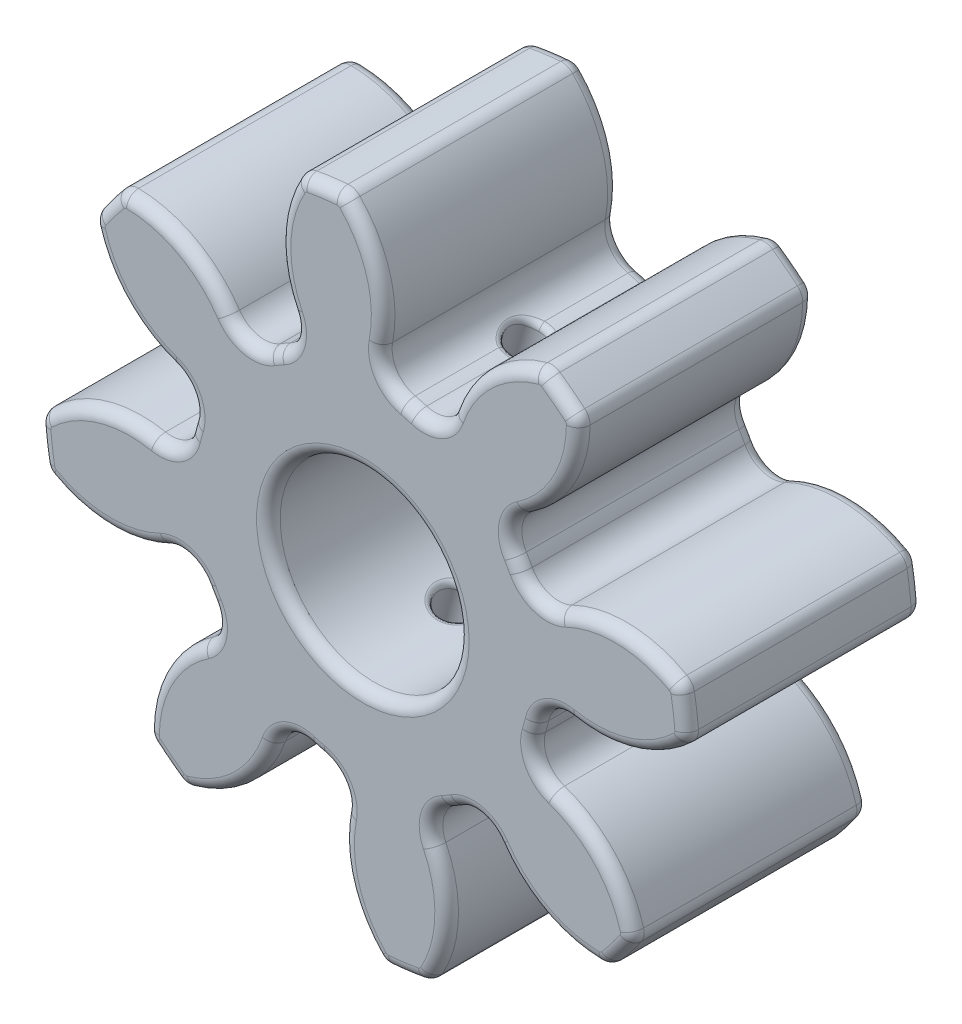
from build123d import *

# Parameters (mm, degrees)
EXTRUDE_1_DEPTH          = 5
PATTERN_CIRCULAR_1_COUNT = 8
SKETCH_6_R               = 7.5625
SKETCH_6_R_2             = 4
EXTRUDE_2_DEPTH          = 5
EXTRUDE_3_DEPTH          = 5
PATTERN_CIRCULAR_2_COUNT = 8
CUT_EXTRUDE_1_DEPTH      = 5
PATTERN_CIRCULAR_3_COUNT = 8
FILLET_1_R               = 0.5
SKETCH_9_R               = 0.75
CUT_EXTRUDE_2_DEPTH      = 10
FILLET_2_R               = 0.25


with BuildPart() as part:
    # Sketch 4 → Extrude 1 (new, symmetric)
    with BuildSketch(Plane.XY):
        with BuildLine():
            ThreePointArc((-0.83713526, 13.724492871), (-1.785764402, 13.633544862), (-2.725815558, 13.47710761))
            ThreePointArc((-2.725815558, 13.47710761), (-3.533626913, 10.269610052), (-2.260782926, 7.216665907))
            ThreePointArc((-2.260782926, 7.216665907), (-0.982170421, 7.498449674), (0.325881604, 7.555475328))
            ThreePointArc((0.325881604, 7.555475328), (0.769508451, 10.833248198), (-0.83713526, 13.724492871))
        make_face()
    extrude(amount=EXTRUDE_1_DEPTH, both=True)


with BuildPart() as pattern_circular_1_1:
    # Pattern Circular 1: pattern copy
    add(part.part.rotate(Axis((0, 0, 0), (0, 0, 1)), 1 * 360 / PATTERN_CIRCULAR_1_COUNT))


with BuildPart() as pattern_circular_1_2:
    # Pattern Circular 1: pattern copy
    add(part.part.rotate(Axis((0, 0, 0), (0, 0, 1)), 2 * 360 / PATTERN_CIRCULAR_1_COUNT))


with BuildPart() as pattern_circular_1_3:
    # Pattern Circular 1: pattern copy
    add(part.part.rotate(Axis((0, 0, 0), (0, 0, 1)), 3 * 360 / PATTERN_CIRCULAR_1_COUNT))


with BuildPart() as pattern_circular_1_4:
    # Pattern Circular 1: pattern copy
    add(part.part.rotate(Axis((0, 0, 0), (0, 0, 1)), 4 * 360 / PATTERN_CIRCULAR_1_COUNT))


with BuildPart() as pattern_circular_1_5:
    # Pattern Circular 1: pattern copy
    add(part.part.rotate(Axis((0, 0, 0), (0, 0, 1)), 5 * 360 / PATTERN_CIRCULAR_1_COUNT))


with BuildPart() as pattern_circular_1_6:
    # Pattern Circular 1: pattern copy
    add(part.part.rotate(Axis((0, 0, 0), (0, 0, 1)), 6 * 360 / PATTERN_CIRCULAR_1_COUNT))


with BuildPart() as pattern_circular_1_7:
    # Pattern Circular 1: pattern copy
    add(part.part.rotate(Axis((0, 0, 0), (0, 0, 1)), 7 * 360 / PATTERN_CIRCULAR_1_COUNT))


with BuildPart() as part_1:
    add(part.part)

    add(pattern_circular_1_1.part)  # Extrude 2 merges Pattern Circular 1_1

    add(pattern_circular_1_2.part)  # Extrude 2 merges Pattern Circular 1_2

    add(pattern_circular_1_3.part)  # Extrude 2 merges Pattern Circular 1_3

    add(pattern_circular_1_4.part)  # Extrude 2 merges Pattern Circular 1_4

    add(pattern_circular_1_5.part)  # Extrude 2 merges Pattern Circular 1_5

    add(pattern_circular_1_6.part)  # Extrude 2 merges Pattern Circular 1_6

    add(pattern_circular_1_7.part)  # Extrude 2 merges Pattern Circular 1_7
    # Sketch 6 → Extrude 2 (add, symmetric)
    with BuildSketch(Plane.XY):
        Circle(SKETCH_6_R)
        Circle(SKETCH_6_R_2, mode=Mode.SUBTRACT)
    extrude(amount=EXTRUDE_2_DEPTH, both=True)

    # Sketch 7 → Extrude 3 (add, symmetric)
    with BuildSketch(Plane.XY):
        with BuildLine():
            ThreePointArc((-2.260782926, 7.216665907), (-2.92171134, 6.975314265), (-3.557347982, 6.673580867))
            ThreePointArc((-3.557347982, 6.673580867), (-2.946423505, 7.403336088), (-3.014068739, 8.352649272))
            ThreePointArc((-3.014068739, 8.352649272), (-2.674493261, 7.76007768), (-2.260782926, 7.216665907))
        make_face()
        with BuildLine():
            ThreePointArc((-5.112094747, 5.572960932), (-5.375018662, 6.203297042), (-5.717635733, 6.794115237))
            ThreePointArc((-5.717635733, 6.794115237), (-4.930031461, 6.259839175), (-3.992367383, 6.422803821))
            ThreePointArc((-3.992367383, 6.422803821), (-4.572019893, 6.02395554), (-5.112094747, 5.572960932))
        make_face()
    extrude_3 = extrude(amount=EXTRUDE_3_DEPTH, both=True)

    # Pattern Circular 2: Extrude 3 ×8 about axis
    pattern_circular_2_axis = Axis((0, 0, 0), (0, 0, 1))
    for i in range(1, PATTERN_CIRCULAR_2_COUNT):
        add(extrude_3.rotate(pattern_circular_2_axis, i * 360 / PATTERN_CIRCULAR_2_COUNT))

    # Sketch 8 → Cut-Extrude 1 (cut, symmetric)
    with BuildSketch(Plane.XY):
        with BuildLine():
            ThreePointArc((-0.83713526, 13.724492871), (-0.982407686, 13.714859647), (-1.127569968, 13.703688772))
            ThreePointArc((-1.127569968, 13.703688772), (-0.852252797, 13.665291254), (-0.619718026, 13.512970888))
            ThreePointArc((-0.619718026, 13.512970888), (-0.726896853, 13.620304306), (-0.83713526, 13.724492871))
        make_face()
        with BuildLine():
            ThreePointArc((-2.725815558, 13.47710761), (-2.805501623, 13.348042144), (-2.881421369, 13.216725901))
            ThreePointArc((-2.881421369, 13.216725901), (-2.695960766, 13.42379661), (-2.439820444, 13.531806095))
            ThreePointArc((-2.439820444, 13.531806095), (-2.582962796, 13.505213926), (-2.725815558, 13.47710761))
        make_face()
    cut_extrude_1 = extrude(amount=CUT_EXTRUDE_1_DEPTH, both=True, mode=Mode.SUBTRACT)

    # Pattern Circular 3: Cut-Extrude 1 ×8 about axis
    pattern_circular_3_axis = Axis((0, 0, 0), (0, 0, 1))
    for i in range(1, PATTERN_CIRCULAR_3_COUNT):
        add(cut_extrude_1.rotate(pattern_circular_3_axis, i * 360 / PATTERN_CIRCULAR_3_COUNT), mode=Mode.SUBTRACT)

    # Fillet 1
    fillet_1_edges = [part_1.edges().sort_by_distance(p)[0] for p in [
        (-3.776939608, 6.551803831, -5),
        (-3.776939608, 6.551803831, 5),
        (-2.946423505, 7.403336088, -5),
        (-2.946423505, 7.403336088, 5),
        (-7.56974652, 8.481471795, -5),
        (-7.56974652, 8.481471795, 5),
        (-4.930031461, 6.259839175, -5),
        (-4.930031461, 6.259839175, 5),
        (1.962125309, 7.303524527, -5),
        (1.962125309, 7.303524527, 5),
        (3.15151311, 7.318385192, -5),
        (3.15151311, 7.318385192, 5),
        (0.644687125, 11.349925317, -5),
        (0.644687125, 11.349925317, 5),
        (0.940316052, 7.912433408, -5),
        (0.940316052, 7.912433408, 5),
        (6.551803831, 3.776939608, -5),
        (6.551803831, 3.776939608, 5),
        (7.403336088, 2.946423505, -5),
        (7.403336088, 2.946423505, 5),
        (-4, 0, -5),
        (8.481471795, 7.56974652, -5),
        (8.481471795, 7.56974652, 5),
        (6.259839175, 4.930031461, -5),
        (-4, 0, 5),
        (6.259839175, 4.930031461, 5),
        (7.303524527, -1.962125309, -5),
        (7.303524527, -1.962125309, 5),
        (7.318385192, -3.15151311, -5),
        (7.318385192, -3.15151311, 5),
        (11.349925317, -0.644687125, -5),
        (11.349925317, -0.644687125, 5),
        (7.912433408, -0.940316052, -5),
        (7.912433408, -0.940316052, 5),
        (3.776939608, -6.551803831, -5),
        (3.776939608, -6.551803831, 5),
        (2.946423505, -7.403336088, -5),
        (2.946423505, -7.403336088, 5),
        (7.56974652, -8.481471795, -5),
        (7.56974652, -8.481471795, 5),
        (4.930031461, -6.259839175, -5),
        (4.930031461, -6.259839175, 5),
        (-1.962125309, -7.303524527, -5),
        (-1.962125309, -7.303524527, 5),
        (-3.15151311, -7.318385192, -5),
        (-3.15151311, -7.318385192, 5),
        (-0.644687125, -11.349925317, -5),
        (-0.644687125, -11.349925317, 5),
        (-0.940316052, -7.912433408, -5),
        (-0.940316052, -7.912433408, 5),
        (-6.551803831, -3.776939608, -5),
        (-6.551803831, -3.776939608, 5),
        (-7.403336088, -2.946423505, -5),
        (-7.403336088, -2.946423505, 5),
        (-8.481471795, -7.56974652, -5),
        (-8.481471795, -7.56974652, 5),
        (-6.259839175, -4.930031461, -5),
        (-6.259839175, -4.930031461, 5),
        (-7.303524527, 1.962125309, -5),
        (-7.303524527, 1.962125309, 5),
        (-7.318385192, 3.15151311, -5),
        (-7.318385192, 3.15151311, 5),
        (-11.349925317, 0.644687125, -5),
        (-11.349925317, 0.644687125, 5),
        (-7.912433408, 0.940316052, -5),
        (-7.912433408, 0.940316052, 5),
        (-1.785764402, 13.633544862, -5),
        (-1.785764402, 13.633544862, 5),
        (-0.852252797, 13.665291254, -5),
        (-0.852252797, 13.665291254, 5),
        (-3.546085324, 10.801004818, -5),
        (-3.546085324, 10.801004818, 5),
        (-2.695960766, 13.42379661, -5),
        (-2.695960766, 13.42379661, 5),
        (8.377645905, 10.903098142, -5),
        (8.377645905, 10.903098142, 5),
        (9.06018638, 10.265453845, -5),
        (9.06018638, 10.265453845, 5),
        (5.130002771, 10.14492473, -5),
        (5.130002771, 10.14492473, 5),
        (7.585725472, 11.398389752, -5),
        (7.585725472, 11.398389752, 5),
        (13.633544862, 1.785764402, -5),
        (13.633544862, 1.785764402, 5),
        (13.665291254, 0.852252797, -5),
        (13.665291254, 0.852252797, 5),
        (10.801004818, 3.546085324, -5),
        (10.801004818, 3.546085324, 5),
        (13.42379661, 2.695960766, -5),
        (13.42379661, 2.695960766, 5),
        (10.903098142, -8.377645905, -5),
        (10.903098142, -8.377645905, 5),
        (10.265453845, -9.06018638, -5),
        (10.265453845, -9.06018638, 5),
        (10.14492473, -5.130002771, -5),
        (10.14492473, -5.130002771, 5),
        (11.398389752, -7.585725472, -5),
        (11.398389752, -7.585725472, 5),
        (1.785764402, -13.633544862, -5),
        (1.785764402, -13.633544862, 5),
        (0.852252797, -13.665291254, -5),
        (0.852252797, -13.665291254, 5),
        (3.546085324, -10.801004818, -5),
        (3.546085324, -10.801004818, 5),
        (2.695960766, -13.42379661, -5),
        (2.695960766, -13.42379661, 5),
        (-8.377645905, -10.903098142, -5),
        (-8.377645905, -10.903098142, 5),
        (-9.06018638, -10.265453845, -5),
        (-9.06018638, -10.265453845, 5),
        (-5.130002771, -10.14492473, -5),
        (-5.130002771, -10.14492473, 5),
        (-7.585725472, -11.398389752, -5),
        (-7.585725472, -11.398389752, 5),
        (-13.633544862, -1.785764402, -5),
        (-13.633544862, -1.785764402, 5),
        (-13.665291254, -0.852252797, -5),
        (-13.665291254, -0.852252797, 5),
        (-10.801004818, -3.546085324, -5),
        (-10.801004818, -3.546085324, 5),
        (-13.42379661, -2.695960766, -5),
        (-13.42379661, -2.695960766, 5),
        (-10.903098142, 8.377645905, -5),
        (-10.903098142, 8.377645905, 5),
        (-10.265453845, 9.06018638, -5),
        (-10.265453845, 9.06018638, 5),
        (-10.14492473, 5.130002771, -5),
        (-10.14492473, 5.130002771, 5),
        (-11.398389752, 7.585725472, -5),
        (-11.398389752, 7.585725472, 5),
    ]]
    fillet(fillet_1_edges, radius=FILLET_1_R)

    # Sketch 9 → Cut-Extrude 2 (cut, symmetric)
    with BuildSketch(Plane(origin=(0, 0, 0), x_dir=(0.9657553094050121, -0.2594545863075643, 0), z_dir=(-0.2594545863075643, -0.9657553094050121, 0))):
        Circle(SKETCH_9_R)
    extrude(amount=CUT_EXTRUDE_2_DEPTH, both=True, mode=Mode.SUBTRACT)

    # Fillet 2
    fillet_2_edges = [part_1.edges().sort_by_distance(p)[0] for p in [
        (-1.37969838, -7.497254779, -0.432483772),
        (-1.743728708, -3.599918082, 1e-09),
        (0.295095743, 3.989099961, 0),
        (1.962125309, 7.303524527, -0.750000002),
        (2.563223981, 7.179295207, 0.432483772),
        (1.962125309, 7.303524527, 0.750000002),
        (1.258595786, 7.575489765, 0),
        (-1.962125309, -7.303524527, -0.750000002),
        (-2.70722875, -7.186307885, 0),
        (-1.962125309, -7.303524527, 0.750000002),
    ]]
    fillet(fillet_2_edges, radius=FILLET_2_R)


solid = part_1.part
